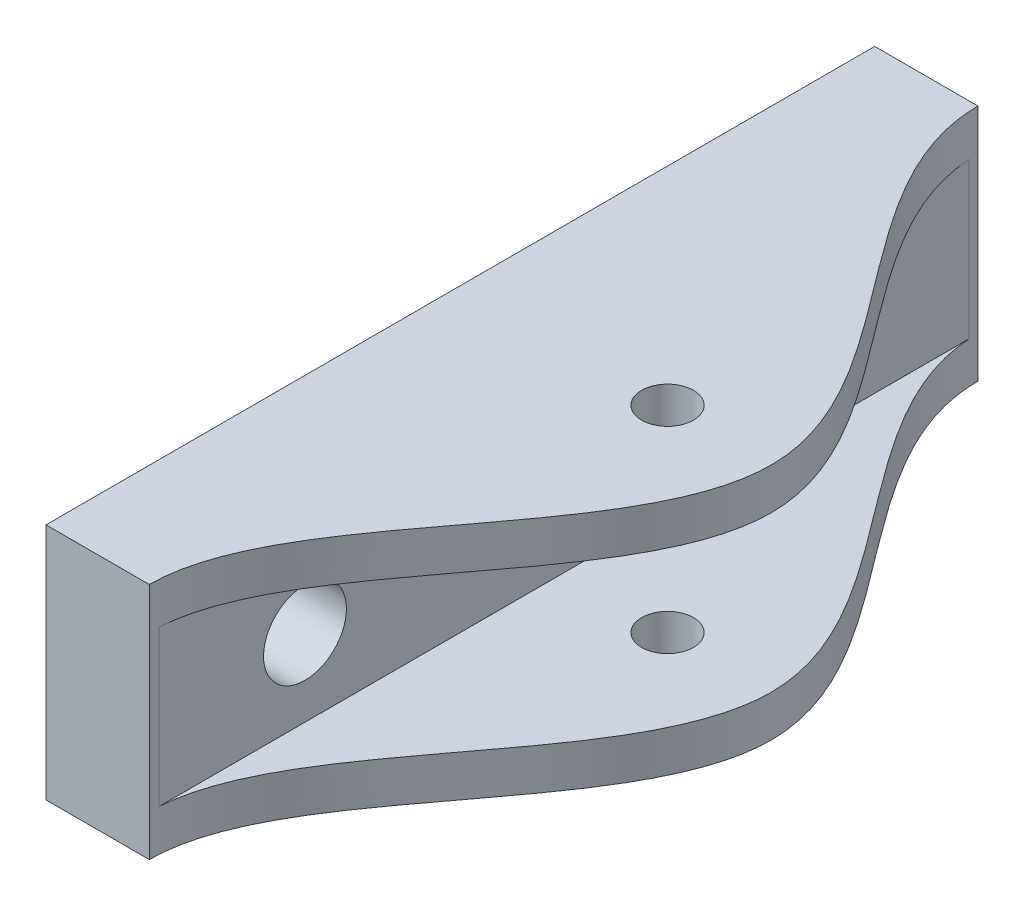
ISO-10303-21;
HEADER;
FILE_DESCRIPTION(('STEP AP214'),'2;1');
FILE_NAME('part.step','',(''),(''),'','','');
FILE_SCHEMA(('AUTOMOTIVE_DESIGN { 1 0 10303 214 1 1 1 1 }'));
ENDSEC;
DATA;
#1=APPLICATION_CONTEXT('core data for automotive mechanical design processes');
#2=APPLICATION_PROTOCOL_DEFINITION('international standard','automotive_design',2000,#1);
#3=PRODUCT_CONTEXT('',#1,'mechanical');
#4=PRODUCT('Part','Part','',(#3));
#5=PRODUCT_RELATED_PRODUCT_CATEGORY('part','',(#4));
#6=PRODUCT_DEFINITION_FORMATION('','',#4);
#7=PRODUCT_DEFINITION_CONTEXT('part definition',#1,'design');
#8=PRODUCT_DEFINITION('design','',#6,#7);
#9=PRODUCT_DEFINITION_SHAPE('','',#8);
#10=(LENGTH_UNIT() NAMED_UNIT(*) SI_UNIT(.MILLI.,.METRE.));
#11=(NAMED_UNIT(*) PLANE_ANGLE_UNIT() SI_UNIT($,.RADIAN.));
#12=(NAMED_UNIT(*) SI_UNIT($,.STERADIAN.) SOLID_ANGLE_UNIT());
#13=UNCERTAINTY_MEASURE_WITH_UNIT(LENGTH_MEASURE(1.E-05),#10,'distance_accuracy_value','');
#14=(GEOMETRIC_REPRESENTATION_CONTEXT(3) GLOBAL_UNCERTAINTY_ASSIGNED_CONTEXT((#13)) GLOBAL_UNIT_ASSIGNED_CONTEXT((#10,
#11,#12)) REPRESENTATION_CONTEXT('',''));
#15=CARTESIAN_POINT('',(0.,0.,0.));
#16=DIRECTION('',(0.,0.,1.));
#17=DIRECTION('',(1.,0.,0.));
#18=AXIS2_PLACEMENT_3D('',#15,#16,#17);
#19=CARTESIAN_POINT('',(-34.8951140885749,-34.3780813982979,80.));
#20=DIRECTION('',(0.,-1.,0.));
#21=DIRECTION('',(0.,0.,-1.));
#22=AXIS2_PLACEMENT_3D('',#19,#20,#21);
#23=PLANE('',#22);
#24=CARTESIAN_POINT('',(-24.8951140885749,-34.3780813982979,40.));
#25=DIRECTION('',(0.,-1.,0.));
#26=DIRECTION('',(0.,0.,-1.));
#27=AXIS2_PLACEMENT_3D('',#24,#25,#26);
#28=CIRCLE('',#27,2.5);
#29=CARTESIAN_POINT('',(-24.8951140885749,-34.3780813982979,37.5));
#30=VERTEX_POINT('',#29);
#31=EDGE_CURVE('E159',#30,#30,#28,.T.);
#32=ORIENTED_EDGE('',*,*,#31,.T.);
#33=EDGE_LOOP('',(#32));
#34=FACE_BOUND('',#33,.T.);
#35=DIRECTION('',(0.,0.,-1.));
#36=VECTOR('',#35,1.);
#37=CARTESIAN_POINT('',(-34.8951140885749,-34.3780813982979,80.));
#38=LINE('',#37,#36);
#39=CARTESIAN_POINT('',(-34.8951140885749,-34.3780813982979,79.0977128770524));
#40=VERTEX_POINT('',#39);
#41=CARTESIAN_POINT('',(-34.8951140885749,-34.3780813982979,0.902287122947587));
#42=VERTEX_POINT('',#41);
#43=EDGE_CURVE('E11',#40,#42,#38,.T.);
#44=ORIENTED_EDGE('',*,*,#43,.F.);
#45=CARTESIAN_POINT('',(-34.9252298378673,-34.3780813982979,80.));
#46=CARTESIAN_POINT('',(-34.9252298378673,-34.3780813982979,66.6666666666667));
#47=CARTESIAN_POINT('',(5.13500166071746,-34.3780813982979,40.));
#48=CARTESIAN_POINT('',(-34.9252298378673,-34.3780813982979,13.3333333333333));
#49=CARTESIAN_POINT('',(-34.9252298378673,-34.3780813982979,0.));
#50=B_SPLINE_CURVE_WITH_KNOTS('',3,(#45,#46,#47,#48,#49),.UNSPECIFIED.,.F.,.F.,(4,1,4),(0.,0.5,
1.),.UNSPECIFIED.);
#51=EDGE_CURVE('E140',#40,#42,#50,.T.);
#52=ORIENTED_EDGE('',*,*,#51,.T.);
#53=EDGE_LOOP('',(#44,#52));
#54=FACE_BOUND('',#53,.T.);
#55=ADVANCED_FACE('F35',(#34,#54),#23,.F.);
#56=CARTESIAN_POINT('',(-34.8951140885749,-19.3780813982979,80.));
#57=DIRECTION('',(-1.,0.,0.));
#58=DIRECTION('',(0.,0.,1.));
#59=AXIS2_PLACEMENT_3D('',#56,#57,#58);
#60=PLANE('',#59);
#61=CARTESIAN_POINT('',(-34.8951140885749,-26.8780813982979,65.));
#62=DIRECTION('',(-1.,0.,0.));
#63=DIRECTION('',(0.,-1.,0.));
#64=AXIS2_PLACEMENT_3D('',#61,#62,#63);
#65=CIRCLE('',#64,4.00000000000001);
#66=CARTESIAN_POINT('',(-34.8951140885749,-30.8780813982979,65.));
#67=VERTEX_POINT('',#66);
#68=EDGE_CURVE('E163',#67,#67,#65,.T.);
#69=ORIENTED_EDGE('',*,*,#68,.T.);
#70=EDGE_LOOP('',(#69));
#71=FACE_BOUND('',#70,.T.);
#72=CARTESIAN_POINT('',(-34.8951140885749,-26.8780813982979,15.));
#73=DIRECTION('',(-1.,0.,0.));
#74=DIRECTION('',(0.,-1.,0.));
#75=AXIS2_PLACEMENT_3D('',#72,#73,#74);
#76=CIRCLE('',#75,4.);
#77=CARTESIAN_POINT('',(-34.8951140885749,-30.8780813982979,15.));
#78=VERTEX_POINT('',#77);
#79=EDGE_CURVE('E121',#78,#78,#76,.T.);
#80=ORIENTED_EDGE('',*,*,#79,.T.);
#81=EDGE_LOOP('',(#80));
#82=FACE_BOUND('',#81,.T.);
#83=DIRECTION('',(0.,0.,-1.));
#84=VECTOR('',#83,1.);
#85=CARTESIAN_POINT('',(-34.8951140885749,-19.3780813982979,80.));
#86=LINE('',#85,#84);
#87=CARTESIAN_POINT('',(-34.8951140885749,-19.3780813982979,79.0977128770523));
#88=VERTEX_POINT('',#87);
#89=CARTESIAN_POINT('',(-34.8951140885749,-19.3780813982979,0.902287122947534));
#90=VERTEX_POINT('',#89);
#91=EDGE_CURVE('E42',#88,#90,#86,.T.);
#92=ORIENTED_EDGE('',*,*,#91,.F.);
#93=DIRECTION('',(0.,-1.,0.));
#94=VECTOR('',#93,1.);
#95=CARTESIAN_POINT('',(-34.8951140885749,-15.3780813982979,79.0977128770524));
#96=LINE('',#95,#94);
#97=EDGE_CURVE('E49',#88,#40,#96,.T.);
#98=ORIENTED_EDGE('',*,*,#97,.T.);
#99=ORIENTED_EDGE('',*,*,#43,.T.);
#100=DIRECTION('',(0.,-1.,0.));
#101=VECTOR('',#100,1.);
#102=CARTESIAN_POINT('',(-34.8951140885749,-15.3780813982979,0.902287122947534));
#103=LINE('',#102,#101);
#104=EDGE_CURVE('E135',#42,#90,#103,.F.);
#105=ORIENTED_EDGE('',*,*,#104,.T.);
#106=EDGE_LOOP('',(#92,#98,#99,#105));
#107=FACE_BOUND('',#106,.T.);
#108=ADVANCED_FACE('F132',(#71,#82,#107),#60,.F.);
#109=CARTESIAN_POINT('',(-34.8951140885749,-19.3780813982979,80.));
#110=DIRECTION('',(0.,1.,0.));
#111=DIRECTION('',(0.,0.,1.));
#112=AXIS2_PLACEMENT_3D('',#109,#110,#111);
#113=PLANE('',#112);
#114=CARTESIAN_POINT('',(-24.8951140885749,-19.3780813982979,40.));
#115=DIRECTION('',(0.,1.,0.));
#116=DIRECTION('',(0.,0.,1.));
#117=AXIS2_PLACEMENT_3D('',#114,#115,#116);
#118=CIRCLE('',#117,2.5);
#119=CARTESIAN_POINT('',(-24.8951140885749,-19.3780813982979,42.5));
#120=VERTEX_POINT('',#119);
#121=EDGE_CURVE('E153',#120,#120,#118,.T.);
#122=ORIENTED_EDGE('',*,*,#121,.T.);
#123=EDGE_LOOP('',(#122));
#124=FACE_BOUND('',#123,.T.);
#125=ORIENTED_EDGE('',*,*,#91,.T.);
#126=CARTESIAN_POINT('',(-34.9252298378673,-19.3780813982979,80.));
#127=CARTESIAN_POINT('',(-34.9252298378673,-19.3780813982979,66.6666666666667));
#128=CARTESIAN_POINT('',(5.13500166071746,-19.3780813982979,40.));
#129=CARTESIAN_POINT('',(-34.9252298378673,-19.3780813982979,13.3333333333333));
#130=CARTESIAN_POINT('',(-34.9252298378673,-19.3780813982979,0.));
#131=B_SPLINE_CURVE_WITH_KNOTS('',3,(#126,#127,#128,#129,#130),.UNSPECIFIED.,.F.,.F.,(4,1,4),
(0.,0.5,1.),.UNSPECIFIED.);
#132=EDGE_CURVE('E129',#90,#88,#131,.F.);
#133=ORIENTED_EDGE('',*,*,#132,.T.);
#134=EDGE_LOOP('',(#125,#133));
#135=FACE_BOUND('',#134,.T.);
#136=ADVANCED_FACE('F128',(#124,#135),#113,.F.);
#137=CARTESIAN_POINT('',(-44.8951140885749,-15.3780813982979,80.));
#138=DIRECTION('',(0.,-1.,0.));
#139=DIRECTION('',(0.,0.,-1.));
#140=AXIS2_PLACEMENT_3D('',#137,#138,#139);
#141=PLANE('',#140);
#142=CARTESIAN_POINT('',(-24.8951140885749,-15.3780813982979,40.));
#143=DIRECTION('',(0.,1.,0.));
#144=DIRECTION('',(0.,0.,1.));
#145=AXIS2_PLACEMENT_3D('',#142,#143,#144);
#146=CIRCLE('',#145,2.5);
#147=CARTESIAN_POINT('',(-24.8951140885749,-15.3780813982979,42.5));
#148=VERTEX_POINT('',#147);
#149=EDGE_CURVE('E154',#148,#148,#146,.T.);
#150=ORIENTED_EDGE('',*,*,#149,.F.);
#151=EDGE_LOOP('',(#150));
#152=FACE_BOUND('',#151,.T.);
#153=DIRECTION('',(-1.,0.,0.));
#154=VECTOR('',#153,1.);
#155=CARTESIAN_POINT('',(-44.8951140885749,-15.3780813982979,80.));
#156=LINE('',#155,#154);
#157=CARTESIAN_POINT('',(-34.9252298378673,-15.3780813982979,80.));
#158=VERTEX_POINT('',#157);
#159=CARTESIAN_POINT('',(-44.8951140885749,-15.3780813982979,80.));
#160=VERTEX_POINT('',#159);
#161=EDGE_CURVE('E97',#158,#160,#156,.T.);
#162=ORIENTED_EDGE('',*,*,#161,.F.);
#163=CARTESIAN_POINT('',(-34.9252298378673,-15.3780813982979,80.));
#164=CARTESIAN_POINT('',(-34.9252298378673,-15.3780813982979,66.6666666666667));
#165=CARTESIAN_POINT('',(5.13500166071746,-15.3780813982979,40.));
#166=CARTESIAN_POINT('',(-34.9252298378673,-15.3780813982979,13.3333333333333));
#167=CARTESIAN_POINT('',(-34.9252298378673,-15.3780813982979,0.));
#168=B_SPLINE_CURVE_WITH_KNOTS('',3,(#163,#164,#165,#166,#167),.UNSPECIFIED.,.F.,.F.,(4,1,4),
(0.,0.5,1.),.UNSPECIFIED.);
#169=CARTESIAN_POINT('',(-34.9252298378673,-15.3780813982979,0.));
#170=VERTEX_POINT('',#169);
#171=EDGE_CURVE('E85',#158,#170,#168,.T.);
#172=ORIENTED_EDGE('',*,*,#171,.T.);
#173=DIRECTION('',(-1.,0.,0.));
#174=VECTOR('',#173,1.);
#175=CARTESIAN_POINT('',(-44.8951140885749,-15.3780813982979,0.));
#176=LINE('',#175,#174);
#177=CARTESIAN_POINT('',(-44.8951140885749,-15.3780813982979,0.));
#178=VERTEX_POINT('',#177);
#179=EDGE_CURVE('E119',#170,#178,#176,.T.);
#180=ORIENTED_EDGE('',*,*,#179,.T.);
#181=DIRECTION('',(0.,0.,-1.));
#182=VECTOR('',#181,1.);
#183=CARTESIAN_POINT('',(-44.8951140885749,-15.3780813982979,80.));
#184=LINE('',#183,#182);
#185=EDGE_CURVE('E104',#160,#178,#184,.T.);
#186=ORIENTED_EDGE('',*,*,#185,.F.);
#187=EDGE_LOOP('',(#162,#172,#180,#186));
#188=FACE_BOUND('',#187,.T.);
#189=ADVANCED_FACE('F102',(#152,#188),#141,.F.);
#190=CARTESIAN_POINT('',(-44.8951140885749,-15.3780813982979,80.));
#191=DIRECTION('',(1.,0.,0.));
#192=DIRECTION('',(0.,1.,0.));
#193=AXIS2_PLACEMENT_3D('',#190,#191,#192);
#194=PLANE('',#193);
#195=CARTESIAN_POINT('',(-44.8951140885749,-26.8780813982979,65.));
#196=DIRECTION('',(-1.,0.,0.));
#197=DIRECTION('',(0.,-1.,0.));
#198=AXIS2_PLACEMENT_3D('',#195,#196,#197);
#199=CIRCLE('',#198,4.00000000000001);
#200=CARTESIAN_POINT('',(-44.8951140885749,-30.8780813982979,65.));
#201=VERTEX_POINT('',#200);
#202=EDGE_CURVE('E162',#201,#201,#199,.T.);
#203=ORIENTED_EDGE('',*,*,#202,.F.);
#204=EDGE_LOOP('',(#203));
#205=FACE_BOUND('',#204,.T.);
#206=CARTESIAN_POINT('',(-44.8951140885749,-26.8780813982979,15.));
#207=DIRECTION('',(-1.,0.,0.));
#208=DIRECTION('',(0.,-1.,0.));
#209=AXIS2_PLACEMENT_3D('',#206,#207,#208);
#210=CIRCLE('',#209,4.);
#211=CARTESIAN_POINT('',(-44.8951140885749,-30.8780813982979,15.));
#212=VERTEX_POINT('',#211);
#213=EDGE_CURVE('E114',#212,#212,#210,.T.);
#214=ORIENTED_EDGE('',*,*,#213,.F.);
#215=EDGE_LOOP('',(#214));
#216=FACE_BOUND('',#215,.T.);
#217=DIRECTION('',(0.,-1.,0.));
#218=VECTOR('',#217,1.);
#219=CARTESIAN_POINT('',(-44.8951140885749,-15.3780813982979,0.));
#220=LINE('',#219,#218);
#221=CARTESIAN_POINT('',(-44.8951140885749,-38.3780813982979,0.));
#222=VERTEX_POINT('',#221);
#223=EDGE_CURVE('E111',#178,#222,#220,.T.);
#224=ORIENTED_EDGE('',*,*,#223,.T.);
#225=DIRECTION('',(0.,0.,-1.));
#226=VECTOR('',#225,1.);
#227=CARTESIAN_POINT('',(-44.8951140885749,-38.3780813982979,80.));
#228=LINE('',#227,#226);
#229=CARTESIAN_POINT('',(-44.8951140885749,-38.3780813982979,80.));
#230=VERTEX_POINT('',#229);
#231=EDGE_CURVE('E118',#230,#222,#228,.T.);
#232=ORIENTED_EDGE('',*,*,#231,.F.);
#233=DIRECTION('',(0.,-1.,0.));
#234=VECTOR('',#233,1.);
#235=CARTESIAN_POINT('',(-44.8951140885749,-15.3780813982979,80.));
#236=LINE('',#235,#234);
#237=EDGE_CURVE('E106',#160,#230,#236,.T.);
#238=ORIENTED_EDGE('',*,*,#237,.F.);
#239=ORIENTED_EDGE('',*,*,#185,.T.);
#240=EDGE_LOOP('',(#224,#232,#238,#239));
#241=FACE_BOUND('',#240,.T.);
#242=ADVANCED_FACE('F175',(#205,#216,#241),#194,.F.);
#243=CARTESIAN_POINT('',(-44.8951140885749,-38.3780813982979,80.));
#244=DIRECTION('',(0.,1.,0.));
#245=DIRECTION('',(0.,0.,1.));
#246=AXIS2_PLACEMENT_3D('',#243,#244,#245);
#247=PLANE('',#246);
#248=CARTESIAN_POINT('',(-24.8951140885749,-38.3780813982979,40.));
#249=DIRECTION('',(0.,1.,0.));
#250=DIRECTION('',(0.,0.,1.));
#251=AXIS2_PLACEMENT_3D('',#248,#249,#250);
#252=CIRCLE('',#251,2.5);
#253=CARTESIAN_POINT('',(-24.8951140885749,-38.3780813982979,42.5));
#254=VERTEX_POINT('',#253);
#255=EDGE_CURVE('E150',#254,#254,#252,.T.);
#256=ORIENTED_EDGE('',*,*,#255,.T.);
#257=EDGE_LOOP('',(#256));
#258=FACE_BOUND('',#257,.T.);
#259=DIRECTION('',(1.,0.,0.));
#260=VECTOR('',#259,1.);
#261=CARTESIAN_POINT('',(-44.8951140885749,-38.3780813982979,0.));
#262=LINE('',#261,#260);
#263=CARTESIAN_POINT('',(-34.9252298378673,-38.3780813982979,0.));
#264=VERTEX_POINT('',#263);
#265=EDGE_CURVE('E107',#222,#264,#262,.T.);
#266=ORIENTED_EDGE('',*,*,#265,.T.);
#267=CARTESIAN_POINT('',(-34.9252298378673,-38.3780813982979,80.));
#268=CARTESIAN_POINT('',(-34.9252298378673,-38.3780813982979,66.6666666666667));
#269=CARTESIAN_POINT('',(5.13500166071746,-38.3780813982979,40.));
#270=CARTESIAN_POINT('',(-34.9252298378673,-38.3780813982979,13.3333333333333));
#271=CARTESIAN_POINT('',(-34.9252298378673,-38.3780813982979,0.));
#272=B_SPLINE_CURVE_WITH_KNOTS('',3,(#267,#268,#269,#270,#271),.UNSPECIFIED.,.F.,.F.,(4,1,4),
(0.,0.5,1.),.UNSPECIFIED.);
#273=CARTESIAN_POINT('',(-34.9252298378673,-38.3780813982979,80.));
#274=VERTEX_POINT('',#273);
#275=EDGE_CURVE('E57',#274,#264,#272,.T.);
#276=ORIENTED_EDGE('',*,*,#275,.F.);
#277=DIRECTION('',(1.,0.,0.));
#278=VECTOR('',#277,1.);
#279=CARTESIAN_POINT('',(-44.8951140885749,-38.3780813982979,80.));
#280=LINE('',#279,#278);
#281=EDGE_CURVE('E100',#230,#274,#280,.T.);
#282=ORIENTED_EDGE('',*,*,#281,.F.);
#283=ORIENTED_EDGE('',*,*,#231,.T.);
#284=EDGE_LOOP('',(#266,#276,#282,#283));
#285=FACE_BOUND('',#284,.T.);
#286=ADVANCED_FACE('F178',(#258,#285),#247,.F.);
#287=CARTESIAN_POINT('',(0.,0.,80.));
#288=DIRECTION('',(0.,0.,-1.));
#289=DIRECTION('',(-1.,0.,0.));
#290=AXIS2_PLACEMENT_3D('',#287,#288,#289);
#291=PLANE('',#290);
#292=ORIENTED_EDGE('',*,*,#281,.T.);
#293=DIRECTION('',(0.,-1.,0.));
#294=VECTOR('',#293,1.);
#295=CARTESIAN_POINT('',(-34.9252298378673,-15.3780813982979,80.));
#296=LINE('',#295,#294);
#297=EDGE_CURVE('E88',#158,#274,#296,.T.);
#298=ORIENTED_EDGE('',*,*,#297,.F.);
#299=ORIENTED_EDGE('',*,*,#161,.T.);
#300=ORIENTED_EDGE('',*,*,#237,.T.);
#301=EDGE_LOOP('',(#292,#298,#299,#300));
#302=FACE_BOUND('',#301,.T.);
#303=ADVANCED_FACE('F96',(#302),#291,.F.);
#304=CARTESIAN_POINT('',(0.,0.,0.));
#305=DIRECTION('',(0.,0.,-1.));
#306=DIRECTION('',(-1.,0.,0.));
#307=AXIS2_PLACEMENT_3D('',#304,#305,#306);
#308=PLANE('',#307);
#309=DIRECTION('',(0.,-1.,0.));
#310=VECTOR('',#309,1.);
#311=CARTESIAN_POINT('',(-34.9252298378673,-15.3780813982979,0.));
#312=LINE('',#311,#310);
#313=EDGE_CURVE('E90',#170,#264,#312,.T.);
#314=ORIENTED_EDGE('',*,*,#313,.T.);
#315=ORIENTED_EDGE('',*,*,#265,.F.);
#316=ORIENTED_EDGE('',*,*,#223,.F.);
#317=ORIENTED_EDGE('',*,*,#179,.F.);
#318=EDGE_LOOP('',(#314,#315,#316,#317));
#319=FACE_BOUND('',#318,.T.);
#320=ADVANCED_FACE('F186',(#319),#308,.T.);
#321=CARTESIAN_POINT('',(-34.8951140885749,-26.8780813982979,15.));
#322=DIRECTION('',(-1.,0.,0.));
#323=DIRECTION('',(0.,-1.,0.));
#324=AXIS2_PLACEMENT_3D('',#321,#322,#323);
#325=CYLINDRICAL_SURFACE('',#324,4.);
#326=ORIENTED_EDGE('',*,*,#79,.F.);
#327=EDGE_LOOP('',(#326));
#328=FACE_BOUND('',#327,.T.);
#329=ORIENTED_EDGE('',*,*,#213,.T.);
#330=EDGE_LOOP('',(#329));
#331=FACE_BOUND('',#330,.T.);
#332=ADVANCED_FACE('F173',(#328,#331),#325,.F.);
#333=CARTESIAN_POINT('',(-34.8951140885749,-26.8780813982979,65.));
#334=DIRECTION('',(-1.,0.,0.));
#335=DIRECTION('',(0.,-1.,0.));
#336=AXIS2_PLACEMENT_3D('',#333,#334,#335);
#337=CYLINDRICAL_SURFACE('',#336,4.00000000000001);
#338=ORIENTED_EDGE('',*,*,#68,.F.);
#339=EDGE_LOOP('',(#338));
#340=FACE_BOUND('',#339,.T.);
#341=ORIENTED_EDGE('',*,*,#202,.T.);
#342=EDGE_LOOP('',(#341));
#343=FACE_BOUND('',#342,.T.);
#344=ADVANCED_FACE('F193',(#340,#343),#337,.F.);
#345=CARTESIAN_POINT('',(-24.8951140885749,-38.3780813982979,40.));
#346=DIRECTION('',(0.,1.,0.));
#347=DIRECTION('',(0.,0.,1.));
#348=AXIS2_PLACEMENT_3D('',#345,#346,#347);
#349=CYLINDRICAL_SURFACE('',#348,2.5);
#350=ORIENTED_EDGE('',*,*,#255,.F.);
#351=EDGE_LOOP('',(#350));
#352=FACE_BOUND('',#351,.T.);
#353=ORIENTED_EDGE('',*,*,#31,.F.);
#354=EDGE_LOOP('',(#353));
#355=FACE_BOUND('',#354,.T.);
#356=ADVANCED_FACE('F212',(#352,#355),#349,.F.);
#357=ORIENTED_EDGE('',*,*,#149,.T.);
#358=EDGE_LOOP('',(#357));
#359=FACE_BOUND('',#358,.T.);
#360=ORIENTED_EDGE('',*,*,#121,.F.);
#361=EDGE_LOOP('',(#360));
#362=FACE_BOUND('',#361,.T.);
#363=ADVANCED_FACE('F207',(#359,#362),#349,.F.);
#364=DIRECTION('',(0.,-1.,0.));
#365=VECTOR('',#364,1.);
#366=SURFACE_OF_LINEAR_EXTRUSION('',#168,#365);
#367=ORIENTED_EDGE('',*,*,#132,.F.);
#368=ORIENTED_EDGE('',*,*,#104,.F.);
#369=ORIENTED_EDGE('',*,*,#51,.F.);
#370=ORIENTED_EDGE('',*,*,#97,.F.);
#371=EDGE_LOOP('',(#367,#368,#369,#370));
#372=FACE_BOUND('',#371,.T.);
#373=ORIENTED_EDGE('',*,*,#313,.F.);
#374=ORIENTED_EDGE('',*,*,#171,.F.);
#375=ORIENTED_EDGE('',*,*,#297,.T.);
#376=ORIENTED_EDGE('',*,*,#275,.T.);
#377=EDGE_LOOP('',(#373,#374,#375,#376));
#378=FACE_BOUND('',#377,.T.);
#379=ADVANCED_FACE('F87',(#372,#378),#366,.F.);
#380=CLOSED_SHELL('',(#55,#108,#136,#189,#242,#286,#303,#320,#332,#344,#356,#363,#379));
#381=MANIFOLD_SOLID_BREP('B2',#380);
#382=ADVANCED_BREP_SHAPE_REPRESENTATION('',(#18,#381),#14);
#383=SHAPE_DEFINITION_REPRESENTATION(#9,#382);
ENDSEC;
END-ISO-10303-21;
